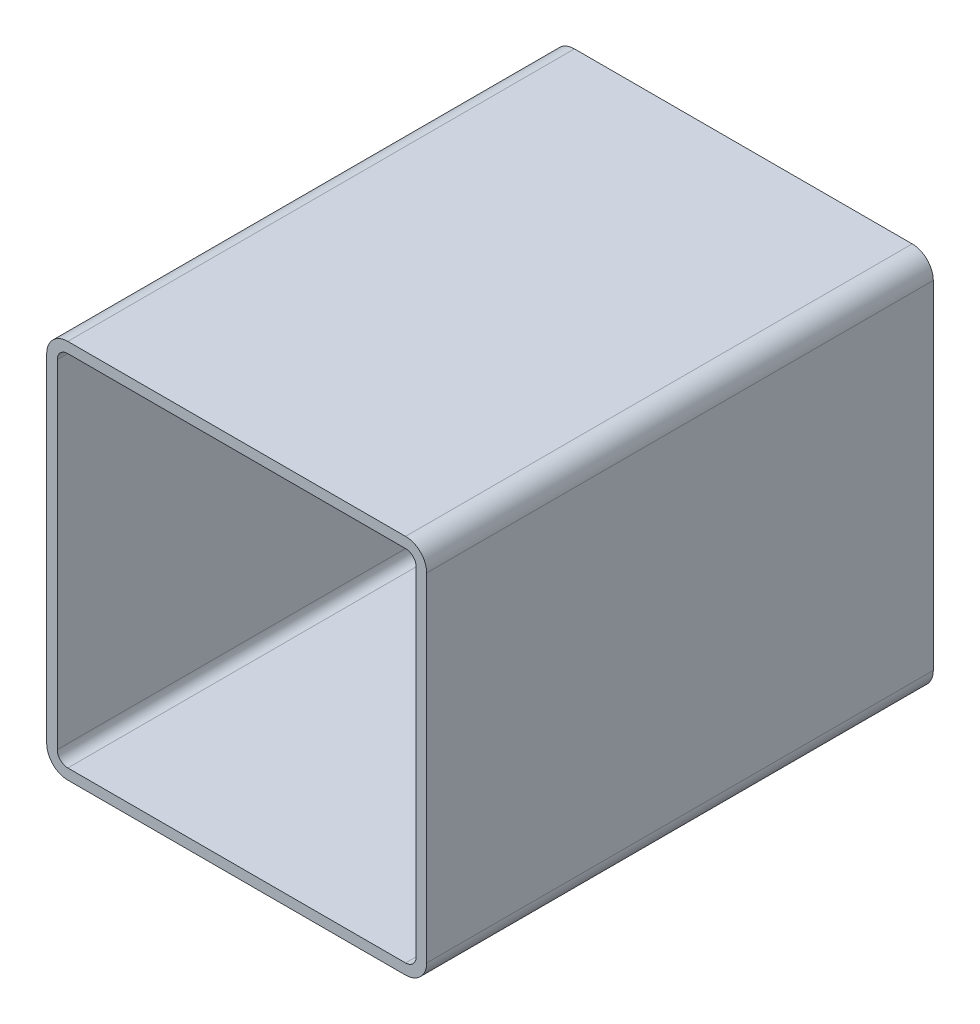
ISO-10303-21;
HEADER;
FILE_DESCRIPTION(('STEP AP214'),'2;1');
FILE_NAME('part.step','',(''),(''),'','','');
FILE_SCHEMA(('AUTOMOTIVE_DESIGN { 1 0 10303 214 1 1 1 1 }'));
ENDSEC;
DATA;
#1=APPLICATION_CONTEXT('core data for automotive mechanical design processes');
#2=APPLICATION_PROTOCOL_DEFINITION('international standard','automotive_design',2000,#1);
#3=PRODUCT_CONTEXT('',#1,'mechanical');
#4=PRODUCT('Part','Part','',(#3));
#5=PRODUCT_RELATED_PRODUCT_CATEGORY('part','',(#4));
#6=PRODUCT_DEFINITION_FORMATION('','',#4);
#7=PRODUCT_DEFINITION_CONTEXT('part definition',#1,'design');
#8=PRODUCT_DEFINITION('design','',#6,#7);
#9=PRODUCT_DEFINITION_SHAPE('','',#8);
#10=(LENGTH_UNIT() NAMED_UNIT(*) SI_UNIT(.MILLI.,.METRE.));
#11=(NAMED_UNIT(*) PLANE_ANGLE_UNIT() SI_UNIT($,.RADIAN.));
#12=(NAMED_UNIT(*) SI_UNIT($,.STERADIAN.) SOLID_ANGLE_UNIT());
#13=UNCERTAINTY_MEASURE_WITH_UNIT(LENGTH_MEASURE(1.E-05),#10,'distance_accuracy_value','');
#14=(GEOMETRIC_REPRESENTATION_CONTEXT(3) GLOBAL_UNCERTAINTY_ASSIGNED_CONTEXT((#13)) GLOBAL_UNIT_ASSIGNED_CONTEXT((#10,
#11,#12)) REPRESENTATION_CONTEXT('',''));
#15=CARTESIAN_POINT('',(0.,0.,0.));
#16=DIRECTION('',(0.,0.,1.));
#17=DIRECTION('',(1.,0.,0.));
#18=AXIS2_PLACEMENT_3D('',#15,#16,#17);
#19=CARTESIAN_POINT('',(13.2770021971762,217.843222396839,304.8));
#20=DIRECTION('',(0.,0.,1.));
#21=DIRECTION('',(1.,0.,0.));
#22=AXIS2_PLACEMENT_3D('',#19,#20,#21);
#23=PLANE('',#22);
#24=CARTESIAN_POINT('',(13.2770021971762,217.843222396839,304.8));
#25=DIRECTION('',(0.,0.,1.));
#26=DIRECTION('',(1.,0.,0.));
#27=AXIS2_PLACEMENT_3D('',#24,#25,#26);
#28=CIRCLE('',#27,12.7);
#29=CARTESIAN_POINT('',(13.2770021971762,230.543222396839,304.8));
#30=VERTEX_POINT('',#29);
#31=CARTESIAN_POINT('',(0.577002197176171,217.843222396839,304.8));
#32=VERTEX_POINT('',#31);
#33=EDGE_CURVE('E211',#30,#32,#28,.T.);
#34=ORIENTED_EDGE('',*,*,#33,.T.);
#35=DIRECTION('',(0.,-1.,0.));
#36=VECTOR('',#35,1.);
#37=CARTESIAN_POINT('',(0.577002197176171,14.6432223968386,304.8));
#38=LINE('',#37,#36);
#39=CARTESIAN_POINT('',(0.577002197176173,14.6432223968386,304.8));
#40=VERTEX_POINT('',#39);
#41=EDGE_CURVE('E214',#32,#40,#38,.T.);
#42=ORIENTED_EDGE('',*,*,#41,.T.);
#43=CARTESIAN_POINT('',(13.2770021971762,14.6432223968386,304.8));
#44=DIRECTION('',(0.,0.,1.));
#45=DIRECTION('',(1.,0.,0.));
#46=AXIS2_PLACEMENT_3D('',#43,#44,#45);
#47=CIRCLE('',#46,12.7);
#48=CARTESIAN_POINT('',(13.2770021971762,1.94322239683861,304.8));
#49=VERTEX_POINT('',#48);
#50=EDGE_CURVE('E217',#40,#49,#47,.T.);
#51=ORIENTED_EDGE('',*,*,#50,.T.);
#52=DIRECTION('',(1.,0.,0.));
#53=VECTOR('',#52,1.);
#54=CARTESIAN_POINT('',(216.477002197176,1.94322239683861,304.8));
#55=LINE('',#54,#53);
#56=CARTESIAN_POINT('',(216.477002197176,1.94322239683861,304.8));
#57=VERTEX_POINT('',#56);
#58=EDGE_CURVE('E219',#49,#57,#55,.T.);
#59=ORIENTED_EDGE('',*,*,#58,.T.);
#60=CARTESIAN_POINT('',(216.477002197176,14.6432223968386,304.8));
#61=DIRECTION('',(0.,0.,1.));
#62=DIRECTION('',(1.,0.,0.));
#63=AXIS2_PLACEMENT_3D('',#60,#61,#62);
#64=CIRCLE('',#63,12.7);
#65=CARTESIAN_POINT('',(229.177002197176,14.6432223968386,304.8));
#66=VERTEX_POINT('',#65);
#67=EDGE_CURVE('E221',#57,#66,#64,.T.);
#68=ORIENTED_EDGE('',*,*,#67,.T.);
#69=DIRECTION('',(0.,1.,0.));
#70=VECTOR('',#69,1.);
#71=CARTESIAN_POINT('',(229.177002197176,217.843222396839,304.8));
#72=LINE('',#71,#70);
#73=CARTESIAN_POINT('',(229.177002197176,217.843222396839,304.8));
#74=VERTEX_POINT('',#73);
#75=EDGE_CURVE('E223',#66,#74,#72,.T.);
#76=ORIENTED_EDGE('',*,*,#75,.T.);
#77=CARTESIAN_POINT('',(216.477002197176,217.843222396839,304.8));
#78=DIRECTION('',(0.,0.,1.));
#79=DIRECTION('',(1.,0.,0.));
#80=AXIS2_PLACEMENT_3D('',#77,#78,#79);
#81=CIRCLE('',#80,12.7);
#82=CARTESIAN_POINT('',(216.477002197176,230.543222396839,304.8));
#83=VERTEX_POINT('',#82);
#84=EDGE_CURVE('E225',#74,#83,#81,.T.);
#85=ORIENTED_EDGE('',*,*,#84,.T.);
#86=DIRECTION('',(-1.,0.,0.));
#87=VECTOR('',#86,1.);
#88=CARTESIAN_POINT('',(13.2770021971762,230.543222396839,304.8));
#89=LINE('',#88,#87);
#90=EDGE_CURVE('E227',#83,#30,#89,.T.);
#91=ORIENTED_EDGE('',*,*,#90,.T.);
#92=EDGE_LOOP('',(#34,#42,#51,#59,#68,#76,#85,#91));
#93=FACE_BOUND('',#92,.T.);
#94=DIRECTION('',(0.,-1.,0.));
#95=VECTOR('',#94,1.);
#96=CARTESIAN_POINT('',(6.92700219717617,14.6432223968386,304.8));
#97=LINE('',#96,#95);
#98=CARTESIAN_POINT('',(6.92700219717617,217.843222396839,304.8));
#99=VERTEX_POINT('',#98);
#100=CARTESIAN_POINT('',(6.92700219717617,14.6432223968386,304.8));
#101=VERTEX_POINT('',#100);
#102=EDGE_CURVE('E154',#99,#101,#97,.T.);
#103=ORIENTED_EDGE('',*,*,#102,.F.);
#104=CARTESIAN_POINT('',(13.2770021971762,217.843222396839,304.8));
#105=DIRECTION('',(0.,0.,1.));
#106=DIRECTION('',(1.,0.,0.));
#107=AXIS2_PLACEMENT_3D('',#104,#105,#106);
#108=CIRCLE('',#107,6.35);
#109=CARTESIAN_POINT('',(13.2770021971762,224.193222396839,304.8));
#110=VERTEX_POINT('',#109);
#111=EDGE_CURVE('E146',#110,#99,#108,.T.);
#112=ORIENTED_EDGE('',*,*,#111,.F.);
#113=DIRECTION('',(-1.,0.,0.));
#114=VECTOR('',#113,1.);
#115=CARTESIAN_POINT('',(13.2770021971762,224.193222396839,304.8));
#116=LINE('',#115,#114);
#117=CARTESIAN_POINT('',(216.477002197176,224.193222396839,304.8));
#118=VERTEX_POINT('',#117);
#119=EDGE_CURVE('E179',#118,#110,#116,.T.);
#120=ORIENTED_EDGE('',*,*,#119,.F.);
#121=CARTESIAN_POINT('',(216.477002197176,217.843222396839,304.8));
#122=DIRECTION('',(0.,0.,1.));
#123=DIRECTION('',(1.,0.,0.));
#124=AXIS2_PLACEMENT_3D('',#121,#122,#123);
#125=CIRCLE('',#124,6.34999999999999);
#126=CARTESIAN_POINT('',(222.827002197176,217.843222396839,304.8));
#127=VERTEX_POINT('',#126);
#128=EDGE_CURVE('E177',#127,#118,#125,.T.);
#129=ORIENTED_EDGE('',*,*,#128,.F.);
#130=DIRECTION('',(0.,1.,0.));
#131=VECTOR('',#130,1.);
#132=CARTESIAN_POINT('',(222.827002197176,217.843222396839,304.8));
#133=LINE('',#132,#131);
#134=CARTESIAN_POINT('',(222.827002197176,14.6432223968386,304.8));
#135=VERTEX_POINT('',#134);
#136=EDGE_CURVE('E175',#135,#127,#133,.T.);
#137=ORIENTED_EDGE('',*,*,#136,.F.);
#138=CARTESIAN_POINT('',(216.477002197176,14.6432223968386,304.8));
#139=DIRECTION('',(0.,0.,1.));
#140=DIRECTION('',(1.,0.,0.));
#141=AXIS2_PLACEMENT_3D('',#138,#139,#140);
#142=CIRCLE('',#141,6.35);
#143=CARTESIAN_POINT('',(216.477002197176,8.29322239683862,304.8));
#144=VERTEX_POINT('',#143);
#145=EDGE_CURVE('E173',#144,#135,#142,.T.);
#146=ORIENTED_EDGE('',*,*,#145,.F.);
#147=DIRECTION('',(1.,0.,0.));
#148=VECTOR('',#147,1.);
#149=CARTESIAN_POINT('',(216.477002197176,8.29322239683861,304.8));
#150=LINE('',#149,#148);
#151=CARTESIAN_POINT('',(13.2770021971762,8.29322239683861,304.8));
#152=VERTEX_POINT('',#151);
#153=EDGE_CURVE('E169',#152,#144,#150,.T.);
#154=ORIENTED_EDGE('',*,*,#153,.F.);
#155=CARTESIAN_POINT('',(13.2770021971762,14.6432223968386,304.8));
#156=DIRECTION('',(0.,0.,1.));
#157=DIRECTION('',(1.,0.,0.));
#158=AXIS2_PLACEMENT_3D('',#155,#156,#157);
#159=CIRCLE('',#158,6.35);
#160=EDGE_CURVE('E167',#101,#152,#159,.T.);
#161=ORIENTED_EDGE('',*,*,#160,.F.);
#162=EDGE_LOOP('',(#103,#112,#120,#129,#137,#146,#154,#161));
#163=FACE_BOUND('',#162,.T.);
#164=ADVANCED_FACE('F33',(#93,#163),#23,.T.);
#165=CARTESIAN_POINT('',(13.2770021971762,217.843222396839,0.));
#166=DIRECTION('',(0.,0.,1.));
#167=DIRECTION('',(1.,0.,0.));
#168=AXIS2_PLACEMENT_3D('',#165,#166,#167);
#169=PLANE('',#168);
#170=CARTESIAN_POINT('',(13.2770021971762,217.843222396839,0.));
#171=DIRECTION('',(0.,0.,1.));
#172=DIRECTION('',(1.,0.,0.));
#173=AXIS2_PLACEMENT_3D('',#170,#171,#172);
#174=CIRCLE('',#173,12.7);
#175=CARTESIAN_POINT('',(13.2770021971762,230.543222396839,0.));
#176=VERTEX_POINT('',#175);
#177=CARTESIAN_POINT('',(0.577002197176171,217.843222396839,0.));
#178=VERTEX_POINT('',#177);
#179=EDGE_CURVE('E162',#176,#178,#174,.T.);
#180=ORIENTED_EDGE('',*,*,#179,.F.);
#181=DIRECTION('',(-1.,0.,0.));
#182=VECTOR('',#181,1.);
#183=CARTESIAN_POINT('',(13.2770021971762,230.543222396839,0.));
#184=LINE('',#183,#182);
#185=CARTESIAN_POINT('',(216.477002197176,230.543222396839,0.));
#186=VERTEX_POINT('',#185);
#187=EDGE_CURVE('E215',#186,#176,#184,.T.);
#188=ORIENTED_EDGE('',*,*,#187,.F.);
#189=CARTESIAN_POINT('',(216.477002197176,217.843222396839,0.));
#190=DIRECTION('',(0.,0.,1.));
#191=DIRECTION('',(1.,0.,0.));
#192=AXIS2_PLACEMENT_3D('',#189,#190,#191);
#193=CIRCLE('',#192,12.7);
#194=CARTESIAN_POINT('',(229.177002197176,217.843222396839,0.));
#195=VERTEX_POINT('',#194);
#196=EDGE_CURVE('E242',#195,#186,#193,.T.);
#197=ORIENTED_EDGE('',*,*,#196,.F.);
#198=DIRECTION('',(0.,1.,0.));
#199=VECTOR('',#198,1.);
#200=CARTESIAN_POINT('',(229.177002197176,217.843222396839,0.));
#201=LINE('',#200,#199);
#202=CARTESIAN_POINT('',(229.177002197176,14.6432223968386,0.));
#203=VERTEX_POINT('',#202);
#204=EDGE_CURVE('E240',#203,#195,#201,.T.);
#205=ORIENTED_EDGE('',*,*,#204,.F.);
#206=CARTESIAN_POINT('',(216.477002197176,14.6432223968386,0.));
#207=DIRECTION('',(0.,0.,1.));
#208=DIRECTION('',(1.,0.,0.));
#209=AXIS2_PLACEMENT_3D('',#206,#207,#208);
#210=CIRCLE('',#209,12.7);
#211=CARTESIAN_POINT('',(216.477002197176,1.94322239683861,0.));
#212=VERTEX_POINT('',#211);
#213=EDGE_CURVE('E238',#212,#203,#210,.T.);
#214=ORIENTED_EDGE('',*,*,#213,.F.);
#215=DIRECTION('',(1.,0.,0.));
#216=VECTOR('',#215,1.);
#217=CARTESIAN_POINT('',(216.477002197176,1.94322239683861,0.));
#218=LINE('',#217,#216);
#219=CARTESIAN_POINT('',(13.2770021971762,1.94322239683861,0.));
#220=VERTEX_POINT('',#219);
#221=EDGE_CURVE('E236',#220,#212,#218,.T.);
#222=ORIENTED_EDGE('',*,*,#221,.F.);
#223=CARTESIAN_POINT('',(13.2770021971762,14.6432223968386,0.));
#224=DIRECTION('',(0.,0.,1.));
#225=DIRECTION('',(1.,0.,0.));
#226=AXIS2_PLACEMENT_3D('',#223,#224,#225);
#227=CIRCLE('',#226,12.7);
#228=CARTESIAN_POINT('',(0.577002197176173,14.6432223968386,0.));
#229=VERTEX_POINT('',#228);
#230=EDGE_CURVE('E234',#229,#220,#227,.T.);
#231=ORIENTED_EDGE('',*,*,#230,.F.);
#232=DIRECTION('',(0.,-1.,0.));
#233=VECTOR('',#232,1.);
#234=CARTESIAN_POINT('',(0.577002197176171,14.6432223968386,0.));
#235=LINE('',#234,#233);
#236=EDGE_CURVE('E232',#178,#229,#235,.T.);
#237=ORIENTED_EDGE('',*,*,#236,.F.);
#238=EDGE_LOOP('',(#180,#188,#197,#205,#214,#222,#231,#237));
#239=FACE_BOUND('',#238,.T.);
#240=CARTESIAN_POINT('',(13.2770021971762,217.843222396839,0.));
#241=DIRECTION('',(0.,0.,1.));
#242=DIRECTION('',(1.,0.,0.));
#243=AXIS2_PLACEMENT_3D('',#240,#241,#242);
#244=CIRCLE('',#243,6.35);
#245=CARTESIAN_POINT('',(13.2770021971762,224.193222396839,0.));
#246=VERTEX_POINT('',#245);
#247=CARTESIAN_POINT('',(6.92700219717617,217.843222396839,0.));
#248=VERTEX_POINT('',#247);
#249=EDGE_CURVE('E56',#246,#248,#244,.T.);
#250=ORIENTED_EDGE('',*,*,#249,.T.);
#251=DIRECTION('',(0.,-1.,0.));
#252=VECTOR('',#251,1.);
#253=CARTESIAN_POINT('',(6.92700219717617,14.6432223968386,0.));
#254=LINE('',#253,#252);
#255=CARTESIAN_POINT('',(6.92700219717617,14.6432223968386,0.));
#256=VERTEX_POINT('',#255);
#257=EDGE_CURVE('E161',#248,#256,#254,.T.);
#258=ORIENTED_EDGE('',*,*,#257,.T.);
#259=CARTESIAN_POINT('',(13.2770021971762,14.6432223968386,0.));
#260=DIRECTION('',(0.,0.,1.));
#261=DIRECTION('',(1.,0.,0.));
#262=AXIS2_PLACEMENT_3D('',#259,#260,#261);
#263=CIRCLE('',#262,6.35);
#264=CARTESIAN_POINT('',(13.2770021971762,8.29322239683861,0.));
#265=VERTEX_POINT('',#264);
#266=EDGE_CURVE('E183',#256,#265,#263,.T.);
#267=ORIENTED_EDGE('',*,*,#266,.T.);
#268=DIRECTION('',(1.,0.,0.));
#269=VECTOR('',#268,1.);
#270=CARTESIAN_POINT('',(216.477002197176,8.29322239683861,0.));
#271=LINE('',#270,#269);
#272=CARTESIAN_POINT('',(216.477002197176,8.29322239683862,0.));
#273=VERTEX_POINT('',#272);
#274=EDGE_CURVE('E186',#265,#273,#271,.T.);
#275=ORIENTED_EDGE('',*,*,#274,.T.);
#276=CARTESIAN_POINT('',(216.477002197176,14.6432223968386,0.));
#277=DIRECTION('',(0.,0.,1.));
#278=DIRECTION('',(1.,0.,0.));
#279=AXIS2_PLACEMENT_3D('',#276,#277,#278);
#280=CIRCLE('',#279,6.35);
#281=CARTESIAN_POINT('',(222.827002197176,14.6432223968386,0.));
#282=VERTEX_POINT('',#281);
#283=EDGE_CURVE('E189',#273,#282,#280,.T.);
#284=ORIENTED_EDGE('',*,*,#283,.T.);
#285=DIRECTION('',(0.,1.,0.));
#286=VECTOR('',#285,1.);
#287=CARTESIAN_POINT('',(222.827002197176,217.843222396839,0.));
#288=LINE('',#287,#286);
#289=CARTESIAN_POINT('',(222.827002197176,217.843222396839,0.));
#290=VERTEX_POINT('',#289);
#291=EDGE_CURVE('E192',#282,#290,#288,.T.);
#292=ORIENTED_EDGE('',*,*,#291,.T.);
#293=CARTESIAN_POINT('',(216.477002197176,217.843222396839,0.));
#294=DIRECTION('',(0.,0.,1.));
#295=DIRECTION('',(1.,0.,0.));
#296=AXIS2_PLACEMENT_3D('',#293,#294,#295);
#297=CIRCLE('',#296,6.34999999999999);
#298=CARTESIAN_POINT('',(216.477002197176,224.193222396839,0.));
#299=VERTEX_POINT('',#298);
#300=EDGE_CURVE('E195',#290,#299,#297,.T.);
#301=ORIENTED_EDGE('',*,*,#300,.T.);
#302=DIRECTION('',(-1.,0.,0.));
#303=VECTOR('',#302,1.);
#304=CARTESIAN_POINT('',(13.2770021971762,224.193222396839,0.));
#305=LINE('',#304,#303);
#306=EDGE_CURVE('E155',#299,#246,#305,.T.);
#307=ORIENTED_EDGE('',*,*,#306,.T.);
#308=EDGE_LOOP('',(#250,#258,#267,#275,#284,#292,#301,#307));
#309=FACE_BOUND('',#308,.T.);
#310=ADVANCED_FACE('F272',(#239,#309),#169,.F.);
#311=CARTESIAN_POINT('',(13.2770021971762,217.843222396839,304.8));
#312=DIRECTION('',(0.,0.,-1.));
#313=DIRECTION('',(-1.,0.,0.));
#314=AXIS2_PLACEMENT_3D('',#311,#312,#313);
#315=CYLINDRICAL_SURFACE('',#314,12.7);
#316=ORIENTED_EDGE('',*,*,#179,.T.);
#317=DIRECTION('',(0.,0.,-1.));
#318=VECTOR('',#317,1.);
#319=CARTESIAN_POINT('',(0.577002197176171,217.843222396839,304.8));
#320=LINE('',#319,#318);
#321=EDGE_CURVE('E11',#32,#178,#320,.T.);
#322=ORIENTED_EDGE('',*,*,#321,.F.);
#323=ORIENTED_EDGE('',*,*,#33,.F.);
#324=DIRECTION('',(0.,0.,-1.));
#325=VECTOR('',#324,1.);
#326=CARTESIAN_POINT('',(13.2770021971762,230.543222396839,304.8));
#327=LINE('',#326,#325);
#328=EDGE_CURVE('E229',#30,#176,#327,.T.);
#329=ORIENTED_EDGE('',*,*,#328,.T.);
#330=EDGE_LOOP('',(#316,#322,#323,#329));
#331=FACE_BOUND('',#330,.T.);
#332=ADVANCED_FACE('F35',(#331),#315,.T.);
#333=CARTESIAN_POINT('',(0.577002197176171,14.6432223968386,304.8));
#334=DIRECTION('',(1.,0.,0.));
#335=DIRECTION('',(0.,0.,-1.));
#336=AXIS2_PLACEMENT_3D('',#333,#334,#335);
#337=PLANE('',#336);
#338=ORIENTED_EDGE('',*,*,#236,.T.);
#339=DIRECTION('',(0.,0.,-1.));
#340=VECTOR('',#339,1.);
#341=CARTESIAN_POINT('',(0.577002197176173,14.6432223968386,304.8));
#342=LINE('',#341,#340);
#343=EDGE_CURVE('E41',#40,#229,#342,.T.);
#344=ORIENTED_EDGE('',*,*,#343,.F.);
#345=ORIENTED_EDGE('',*,*,#41,.F.);
#346=ORIENTED_EDGE('',*,*,#321,.T.);
#347=EDGE_LOOP('',(#338,#344,#345,#346));
#348=FACE_BOUND('',#347,.T.);
#349=ADVANCED_FACE('F289',(#348),#337,.F.);
#350=CARTESIAN_POINT('',(13.2770021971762,14.6432223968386,304.8));
#351=DIRECTION('',(0.,0.,-1.));
#352=DIRECTION('',(-1.,0.,0.));
#353=AXIS2_PLACEMENT_3D('',#350,#351,#352);
#354=CYLINDRICAL_SURFACE('',#353,12.7);
#355=ORIENTED_EDGE('',*,*,#230,.T.);
#356=DIRECTION('',(0.,0.,-1.));
#357=VECTOR('',#356,1.);
#358=CARTESIAN_POINT('',(13.2770021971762,1.94322239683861,304.8));
#359=LINE('',#358,#357);
#360=EDGE_CURVE('E259',#49,#220,#359,.T.);
#361=ORIENTED_EDGE('',*,*,#360,.F.);
#362=ORIENTED_EDGE('',*,*,#50,.F.);
#363=ORIENTED_EDGE('',*,*,#343,.T.);
#364=EDGE_LOOP('',(#355,#361,#362,#363));
#365=FACE_BOUND('',#364,.T.);
#366=ADVANCED_FACE('F266',(#365),#354,.T.);
#367=CARTESIAN_POINT('',(216.477002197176,1.94322239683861,304.8));
#368=DIRECTION('',(0.,1.,0.));
#369=DIRECTION('',(0.,0.,1.));
#370=AXIS2_PLACEMENT_3D('',#367,#368,#369);
#371=PLANE('',#370);
#372=ORIENTED_EDGE('',*,*,#221,.T.);
#373=DIRECTION('',(0.,0.,-1.));
#374=VECTOR('',#373,1.);
#375=CARTESIAN_POINT('',(216.477002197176,1.94322239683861,304.8));
#376=LINE('',#375,#374);
#377=EDGE_CURVE('E256',#57,#212,#376,.T.);
#378=ORIENTED_EDGE('',*,*,#377,.F.);
#379=ORIENTED_EDGE('',*,*,#58,.F.);
#380=ORIENTED_EDGE('',*,*,#360,.T.);
#381=EDGE_LOOP('',(#372,#378,#379,#380));
#382=FACE_BOUND('',#381,.T.);
#383=ADVANCED_FACE('F278',(#382),#371,.F.);
#384=CARTESIAN_POINT('',(216.477002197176,14.6432223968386,304.8));
#385=DIRECTION('',(0.,0.,-1.));
#386=DIRECTION('',(-1.,0.,0.));
#387=AXIS2_PLACEMENT_3D('',#384,#385,#386);
#388=CYLINDRICAL_SURFACE('',#387,12.7);
#389=ORIENTED_EDGE('',*,*,#213,.T.);
#390=DIRECTION('',(0.,0.,-1.));
#391=VECTOR('',#390,1.);
#392=CARTESIAN_POINT('',(229.177002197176,14.6432223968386,304.8));
#393=LINE('',#392,#391);
#394=EDGE_CURVE('E253',#66,#203,#393,.T.);
#395=ORIENTED_EDGE('',*,*,#394,.F.);
#396=ORIENTED_EDGE('',*,*,#67,.F.);
#397=ORIENTED_EDGE('',*,*,#377,.T.);
#398=EDGE_LOOP('',(#389,#395,#396,#397));
#399=FACE_BOUND('',#398,.T.);
#400=ADVANCED_FACE('F282',(#399),#388,.T.);
#401=CARTESIAN_POINT('',(229.177002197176,217.843222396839,304.8));
#402=DIRECTION('',(-1.,0.,0.));
#403=DIRECTION('',(0.,0.,1.));
#404=AXIS2_PLACEMENT_3D('',#401,#402,#403);
#405=PLANE('',#404);
#406=ORIENTED_EDGE('',*,*,#204,.T.);
#407=DIRECTION('',(0.,0.,-1.));
#408=VECTOR('',#407,1.);
#409=CARTESIAN_POINT('',(229.177002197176,217.843222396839,304.8));
#410=LINE('',#409,#408);
#411=EDGE_CURVE('E250',#74,#195,#410,.T.);
#412=ORIENTED_EDGE('',*,*,#411,.F.);
#413=ORIENTED_EDGE('',*,*,#75,.F.);
#414=ORIENTED_EDGE('',*,*,#394,.T.);
#415=EDGE_LOOP('',(#406,#412,#413,#414));
#416=FACE_BOUND('',#415,.T.);
#417=ADVANCED_FACE('F302',(#416),#405,.F.);
#418=CARTESIAN_POINT('',(216.477002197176,217.843222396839,304.8));
#419=DIRECTION('',(0.,0.,-1.));
#420=DIRECTION('',(-1.,0.,0.));
#421=AXIS2_PLACEMENT_3D('',#418,#419,#420);
#422=CYLINDRICAL_SURFACE('',#421,12.7);
#423=ORIENTED_EDGE('',*,*,#196,.T.);
#424=DIRECTION('',(0.,0.,-1.));
#425=VECTOR('',#424,1.);
#426=CARTESIAN_POINT('',(216.477002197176,230.543222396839,304.8));
#427=LINE('',#426,#425);
#428=EDGE_CURVE('E247',#83,#186,#427,.T.);
#429=ORIENTED_EDGE('',*,*,#428,.F.);
#430=ORIENTED_EDGE('',*,*,#84,.F.);
#431=ORIENTED_EDGE('',*,*,#411,.T.);
#432=EDGE_LOOP('',(#423,#429,#430,#431));
#433=FACE_BOUND('',#432,.T.);
#434=ADVANCED_FACE('F300',(#433),#422,.T.);
#435=CARTESIAN_POINT('',(13.2770021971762,230.543222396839,304.8));
#436=DIRECTION('',(0.,-1.,0.));
#437=DIRECTION('',(0.,0.,-1.));
#438=AXIS2_PLACEMENT_3D('',#435,#436,#437);
#439=PLANE('',#438);
#440=ORIENTED_EDGE('',*,*,#187,.T.);
#441=ORIENTED_EDGE('',*,*,#328,.F.);
#442=ORIENTED_EDGE('',*,*,#90,.F.);
#443=ORIENTED_EDGE('',*,*,#428,.T.);
#444=EDGE_LOOP('',(#440,#441,#442,#443));
#445=FACE_BOUND('',#444,.T.);
#446=ADVANCED_FACE('F295',(#445),#439,.F.);
#447=CARTESIAN_POINT('',(13.2770021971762,217.843222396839,304.8));
#448=DIRECTION('',(0.,0.,-1.));
#449=DIRECTION('',(-1.,0.,0.));
#450=AXIS2_PLACEMENT_3D('',#447,#448,#449);
#451=CYLINDRICAL_SURFACE('',#450,6.35);
#452=ORIENTED_EDGE('',*,*,#249,.F.);
#453=DIRECTION('',(0.,0.,-1.));
#454=VECTOR('',#453,1.);
#455=CARTESIAN_POINT('',(13.2770021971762,224.193222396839,304.8));
#456=LINE('',#455,#454);
#457=EDGE_CURVE('E150',#110,#246,#456,.T.);
#458=ORIENTED_EDGE('',*,*,#457,.F.);
#459=ORIENTED_EDGE('',*,*,#111,.T.);
#460=DIRECTION('',(0.,0.,-1.));
#461=VECTOR('',#460,1.);
#462=CARTESIAN_POINT('',(6.92700219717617,217.843222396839,304.8));
#463=LINE('',#462,#461);
#464=EDGE_CURVE('E149',#99,#248,#463,.T.);
#465=ORIENTED_EDGE('',*,*,#464,.T.);
#466=EDGE_LOOP('',(#452,#458,#459,#465));
#467=FACE_BOUND('',#466,.T.);
#468=ADVANCED_FACE('F148',(#467),#451,.F.);
#469=CARTESIAN_POINT('',(6.92700219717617,14.6432223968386,304.8));
#470=DIRECTION('',(1.,0.,0.));
#471=DIRECTION('',(0.,0.,-1.));
#472=AXIS2_PLACEMENT_3D('',#469,#470,#471);
#473=PLANE('',#472);
#474=ORIENTED_EDGE('',*,*,#257,.F.);
#475=ORIENTED_EDGE('',*,*,#464,.F.);
#476=ORIENTED_EDGE('',*,*,#102,.T.);
#477=DIRECTION('',(0.,0.,-1.));
#478=VECTOR('',#477,1.);
#479=CARTESIAN_POINT('',(6.92700219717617,14.6432223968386,304.8));
#480=LINE('',#479,#478);
#481=EDGE_CURVE('E163',#101,#256,#480,.T.);
#482=ORIENTED_EDGE('',*,*,#481,.T.);
#483=EDGE_LOOP('',(#474,#475,#476,#482));
#484=FACE_BOUND('',#483,.T.);
#485=ADVANCED_FACE('F158',(#484),#473,.T.);
#486=CARTESIAN_POINT('',(13.2770021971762,14.6432223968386,304.8));
#487=DIRECTION('',(0.,0.,-1.));
#488=DIRECTION('',(-1.,0.,0.));
#489=AXIS2_PLACEMENT_3D('',#486,#487,#488);
#490=CYLINDRICAL_SURFACE('',#489,6.35);
#491=ORIENTED_EDGE('',*,*,#266,.F.);
#492=ORIENTED_EDGE('',*,*,#481,.F.);
#493=ORIENTED_EDGE('',*,*,#160,.T.);
#494=DIRECTION('',(0.,0.,-1.));
#495=VECTOR('',#494,1.);
#496=CARTESIAN_POINT('',(13.2770021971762,8.29322239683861,304.8));
#497=LINE('',#496,#495);
#498=EDGE_CURVE('E208',#152,#265,#497,.T.);
#499=ORIENTED_EDGE('',*,*,#498,.T.);
#500=EDGE_LOOP('',(#491,#492,#493,#499));
#501=FACE_BOUND('',#500,.T.);
#502=ADVANCED_FACE('F327',(#501),#490,.F.);
#503=CARTESIAN_POINT('',(216.477002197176,8.29322239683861,304.8));
#504=DIRECTION('',(0.,1.,0.));
#505=DIRECTION('',(0.,0.,1.));
#506=AXIS2_PLACEMENT_3D('',#503,#504,#505);
#507=PLANE('',#506);
#508=ORIENTED_EDGE('',*,*,#274,.F.);
#509=ORIENTED_EDGE('',*,*,#498,.F.);
#510=ORIENTED_EDGE('',*,*,#153,.T.);
#511=DIRECTION('',(0.,0.,-1.));
#512=VECTOR('',#511,1.);
#513=CARTESIAN_POINT('',(216.477002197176,8.29322239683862,304.8));
#514=LINE('',#513,#512);
#515=EDGE_CURVE('E206',#144,#273,#514,.T.);
#516=ORIENTED_EDGE('',*,*,#515,.T.);
#517=EDGE_LOOP('',(#508,#509,#510,#516));
#518=FACE_BOUND('',#517,.T.);
#519=ADVANCED_FACE('F331',(#518),#507,.T.);
#520=CARTESIAN_POINT('',(216.477002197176,14.6432223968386,304.8));
#521=DIRECTION('',(0.,0.,-1.));
#522=DIRECTION('',(-1.,0.,0.));
#523=AXIS2_PLACEMENT_3D('',#520,#521,#522);
#524=CYLINDRICAL_SURFACE('',#523,6.35);
#525=ORIENTED_EDGE('',*,*,#283,.F.);
#526=ORIENTED_EDGE('',*,*,#515,.F.);
#527=ORIENTED_EDGE('',*,*,#145,.T.);
#528=DIRECTION('',(0.,0.,-1.));
#529=VECTOR('',#528,1.);
#530=CARTESIAN_POINT('',(222.827002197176,14.6432223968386,304.8));
#531=LINE('',#530,#529);
#532=EDGE_CURVE('E204',#135,#282,#531,.T.);
#533=ORIENTED_EDGE('',*,*,#532,.T.);
#534=EDGE_LOOP('',(#525,#526,#527,#533));
#535=FACE_BOUND('',#534,.T.);
#536=ADVANCED_FACE('F337',(#535),#524,.F.);
#537=CARTESIAN_POINT('',(222.827002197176,217.843222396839,304.8));
#538=DIRECTION('',(-1.,0.,0.));
#539=DIRECTION('',(0.,0.,1.));
#540=AXIS2_PLACEMENT_3D('',#537,#538,#539);
#541=PLANE('',#540);
#542=ORIENTED_EDGE('',*,*,#291,.F.);
#543=ORIENTED_EDGE('',*,*,#532,.F.);
#544=ORIENTED_EDGE('',*,*,#136,.T.);
#545=DIRECTION('',(0.,0.,-1.));
#546=VECTOR('',#545,1.);
#547=CARTESIAN_POINT('',(222.827002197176,217.843222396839,304.8));
#548=LINE('',#547,#546);
#549=EDGE_CURVE('E202',#127,#290,#548,.T.);
#550=ORIENTED_EDGE('',*,*,#549,.T.);
#551=EDGE_LOOP('',(#542,#543,#544,#550));
#552=FACE_BOUND('',#551,.T.);
#553=ADVANCED_FACE('F341',(#552),#541,.T.);
#554=CARTESIAN_POINT('',(216.477002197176,217.843222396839,304.8));
#555=DIRECTION('',(0.,0.,-1.));
#556=DIRECTION('',(-1.,0.,0.));
#557=AXIS2_PLACEMENT_3D('',#554,#555,#556);
#558=CYLINDRICAL_SURFACE('',#557,6.34999999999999);
#559=ORIENTED_EDGE('',*,*,#300,.F.);
#560=ORIENTED_EDGE('',*,*,#549,.F.);
#561=ORIENTED_EDGE('',*,*,#128,.T.);
#562=DIRECTION('',(0.,0.,-1.));
#563=VECTOR('',#562,1.);
#564=CARTESIAN_POINT('',(216.477002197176,224.193222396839,304.8));
#565=LINE('',#564,#563);
#566=EDGE_CURVE('E48',#118,#299,#565,.T.);
#567=ORIENTED_EDGE('',*,*,#566,.T.);
#568=EDGE_LOOP('',(#559,#560,#561,#567));
#569=FACE_BOUND('',#568,.T.);
#570=ADVANCED_FACE('F345',(#569),#558,.F.);
#571=CARTESIAN_POINT('',(13.2770021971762,224.193222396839,304.8));
#572=DIRECTION('',(0.,-1.,0.));
#573=DIRECTION('',(0.,0.,-1.));
#574=AXIS2_PLACEMENT_3D('',#571,#572,#573);
#575=PLANE('',#574);
#576=ORIENTED_EDGE('',*,*,#306,.F.);
#577=ORIENTED_EDGE('',*,*,#566,.F.);
#578=ORIENTED_EDGE('',*,*,#119,.T.);
#579=ORIENTED_EDGE('',*,*,#457,.T.);
#580=EDGE_LOOP('',(#576,#577,#578,#579));
#581=FACE_BOUND('',#580,.T.);
#582=ADVANCED_FACE('F349',(#581),#575,.T.);
#583=CLOSED_SHELL('',(#164,#310,#332,#349,#366,#383,#400,#417,#434,#446,#468,#485,#502,#519,
#536,#553,#570,#582));
#584=MANIFOLD_SOLID_BREP('B2',#583);
#585=ADVANCED_BREP_SHAPE_REPRESENTATION('',(#18,#584),#14);
#586=SHAPE_DEFINITION_REPRESENTATION(#9,#585);
ENDSEC;
END-ISO-10303-21;
